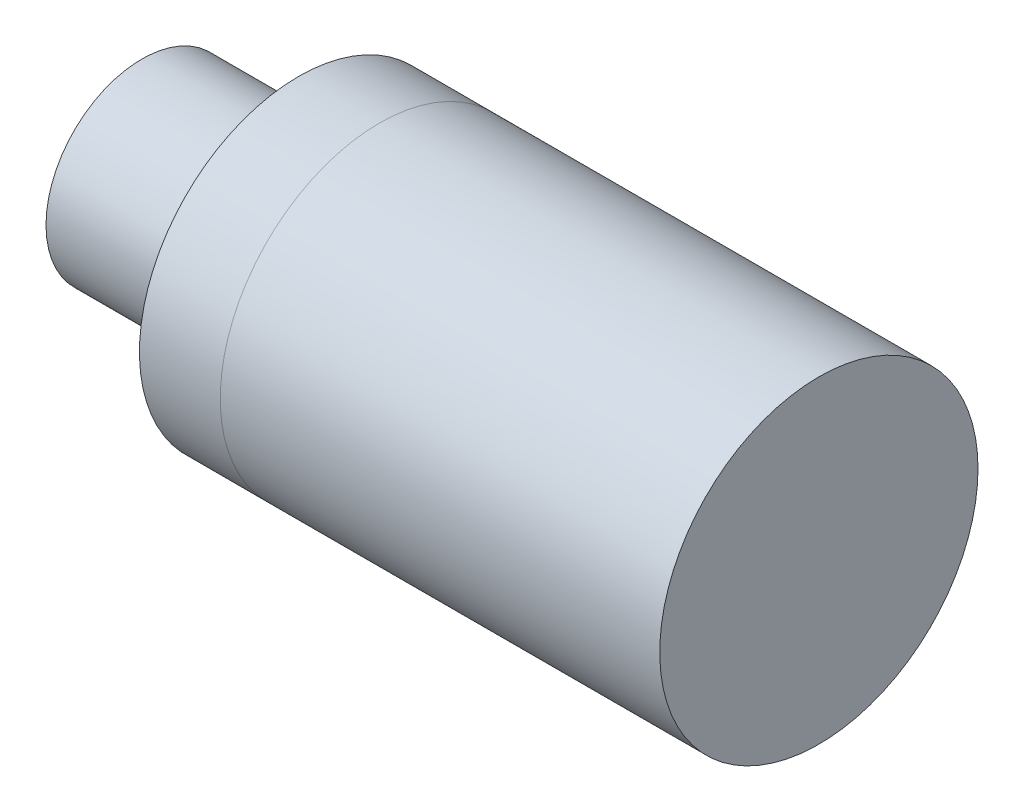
from build123d import *

# Parameters (mm, degrees)
SKETCH1_R      = 2.413
EXTRUDE1_DEPTH = 3.937
SKETCH2_R      = 4.0005
EXTRUDE2_DEPTH = 13.081


with BuildPart() as part:
    # Sketch1 → Extrude1 (new body)
    with BuildSketch(Plane(origin=(0, 0, 0), x_dir=(0, 0, -1), z_dir=(1, 0, 0))):
        Circle(SKETCH1_R)
    extrude(amount=EXTRUDE1_DEPTH)

    # Sketch2 → Extrude2 (add)
    with BuildSketch(Plane(origin=(3.937, 0, 0), x_dir=(0, 0, -1), z_dir=(1, 0, 0))):
        Circle(SKETCH2_R)
    extrude(amount=EXTRUDE2_DEPTH)


solid = part.part
